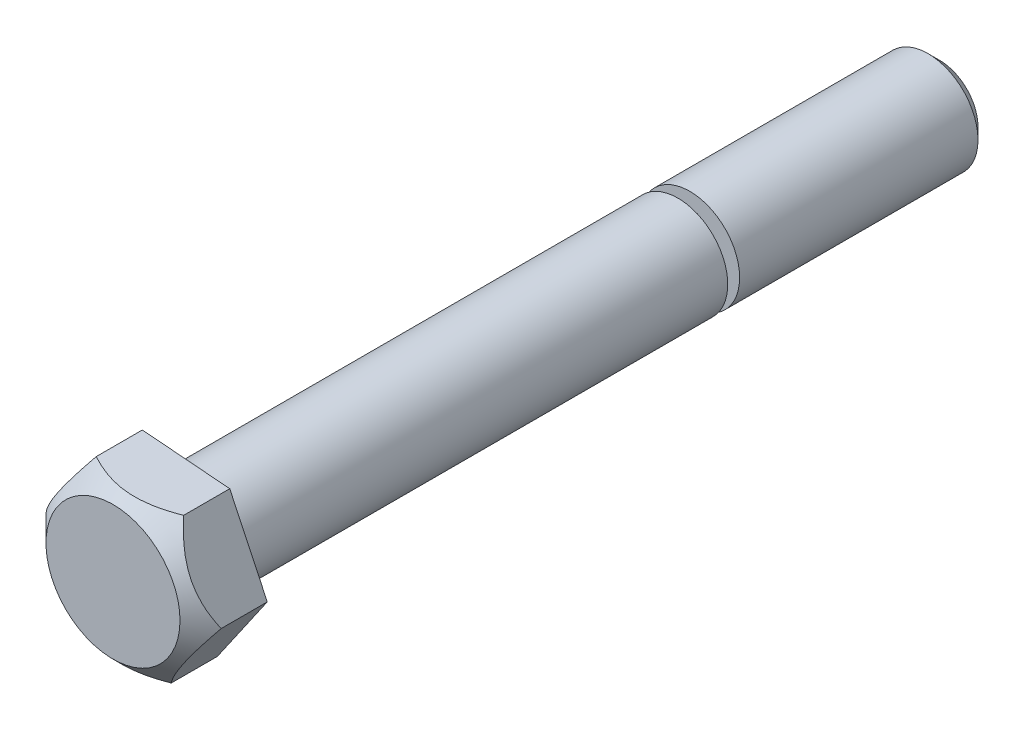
from build123d import *

# Parameters (mm, degrees)
SKETCH2_R           = 2.0828
BOSS_EXTRUDE1_DEPTH = 31.75
BOSS_EXTRUDE2_DEPTH = 2.794
SKETCH5_W           = 2.182793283
SKETCH5_H           = 0.494902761
SKETCH6_W           = 0.464780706
SKETCH6_H           = 2.137648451


with BuildPart() as part:
    # Sketch2 → Boss-Extrude1 (new body)
    with BuildSketch(Plane.XY):
        Circle(SKETCH2_R)
    extrude(amount=BOSS_EXTRUDE1_DEPTH)

    # Sketch3 → Boss-Extrude2 (add)
    with BuildSketch(Plane.XY.offset(31.75)):
        Polygon((3.654011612, -0.298383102), (2.085413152, 3.015275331), (-1.56859846, 3.313658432), (-3.654011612, 0.298383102), (-2.085413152, -3.015275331), (1.56859846, -3.313658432), align=None)
    extrude(amount=BOSS_EXTRUDE2_DEPTH)

    # Sketch5 → Cut-Revolve1 (revolve, cut)
    with BuildSketch(Plane(origin=(0, 0, 0), x_dir=(1, 0, 0), z_dir=(0, 1, 0)), mode=Mode.PRIVATE) as cut_revolve1_sk:
        with Locations((2.30185564, -10.686039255)):
            Rectangle(SKETCH5_W, SKETCH5_H)
        Polygon((0.320888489, -37.023731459), (5.375775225, -31.968844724), (5.375775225, -37.023731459), align=None)
    revolve(cut_revolve1_sk.sketch.rotate(Axis((0, 0, 0), (0, 0, 1)), 180), axis=Axis((0, 0, 0), (0, 0, 1)), mode=Mode.SUBTRACT)

    # Sketch6 → Cut-Revolve2 (revolve, cut)
    with BuildSketch(Plane(origin=(0, 0, 0), x_dir=(0, 0, -1), z_dir=(1, 0, 0)), mode=Mode.PRIVATE) as cut_revolve2_sk:
        with Locations((-49.064112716, 2.34232143)):
            Rectangle(SKETCH6_W, SKETCH6_H)
        Polygon((-1.803718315, 3.411145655), (1.439801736, 0.167625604), (1.439801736, 3.411145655), align=None)
    revolve(cut_revolve2_sk.sketch.rotate(Axis((0, 0, 0), (0, 0, -1)), 90), axis=Axis((0, 0, 0), (0, 0, -1)), mode=Mode.SUBTRACT)


solid = part.part
